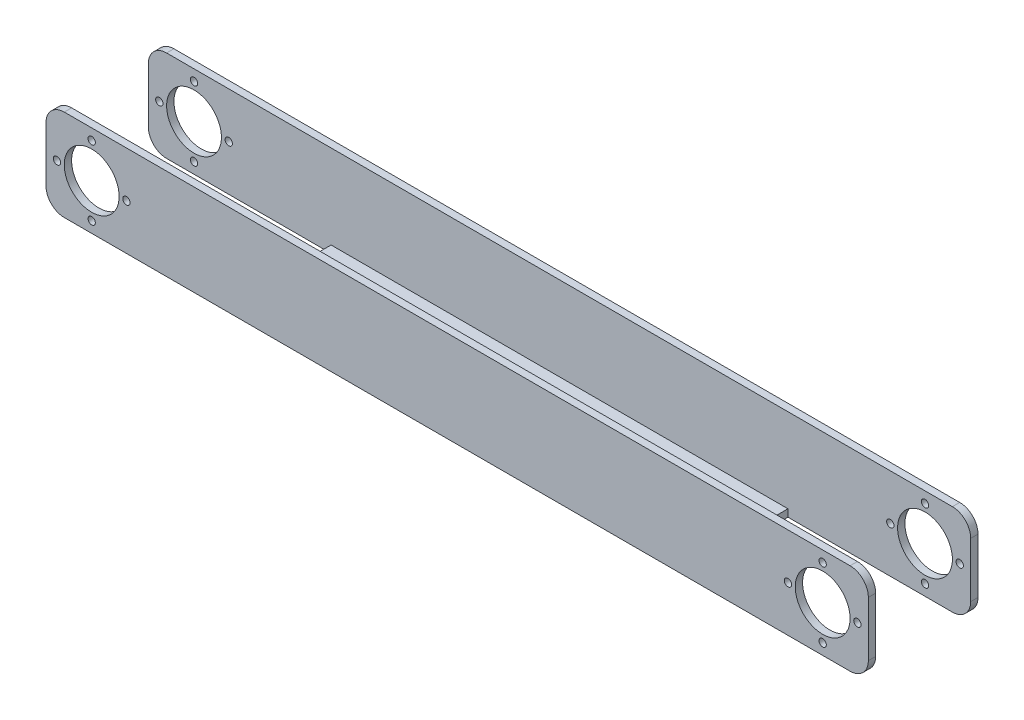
from build123d import *

# Parameters (mm, degrees)
SKETCH1_W           = 225
SKETCH1_H           = 25
BOSS_EXTRUDE1_DEPTH = 30
SHELL1_T            = -2
SKETCH5_W           = 50
SKETCH5_H           = 26
CUT_EXTRUDE4_DEPTH  = 120.085053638
SKETCH4_R           = 7.5
SKETCH4_R_2         = 1
CUT_EXTRUDE3_DEPTH  = 118.100384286
FILLET2_R           = 5


with BuildPart() as part:
    # Sketch1 → Boss-Extrude1 (new body)
    with BuildSketch(Plane.XY):
        Rectangle(SKETCH1_W, SKETCH1_H)
    extrude(amount=BOSS_EXTRUDE1_DEPTH)

    # Shell1
    shell1_openings = [part.faces().sort_by_distance(p)[0] for p in [
        (-112.5, 0, 15),
        (0, 12.5, 15),
        (112.5, 0, 15),
    ]]
    offset(amount=SHELL1_T, openings=shell1_openings, kind=Kind.INTERSECTION)

    # Sketch5 → Cut-Extrude4 (cut, through all)
    with BuildSketch(Plane.XZ.offset(12.5)):
        with Locations((-87.5, 15)):
            Rectangle(SKETCH5_W, SKETCH5_H)
        with Locations((87.5, 15)):
            Rectangle(SKETCH5_W, SKETCH5_H)
    extrude(amount=-CUT_EXTRUDE4_DEPTH, mode=Mode.SUBTRACT)

    # Sketch4 → Cut-Extrude3 (cut, through all)
    with BuildSketch(Plane.XY.offset(30)):
        with Locations((-100, 0)):
            Circle(SKETCH4_R)
        with Locations((100, 0)):
            Circle(SKETCH4_R)
        with Locations((100, 9.5)):
            Circle(SKETCH4_R_2)
        with Locations((109.5, 0)):
            Circle(SKETCH4_R_2)
        with Locations((100, -9.5)):
            Circle(SKETCH4_R_2)
        with Locations((90.5, 0)):
            Circle(SKETCH4_R_2)
        with Locations((-90.5, 0)):
            Circle(SKETCH4_R_2)
        with Locations((-100, -9.5)):
            Circle(SKETCH4_R_2)
        with Locations((-109.5, 0)):
            Circle(SKETCH4_R_2)
        with Locations((-100, 9.5)):
            Circle(SKETCH4_R_2)
    extrude(amount=-CUT_EXTRUDE3_DEPTH, mode=Mode.SUBTRACT)

    # Fillet2
    fillet2_edges = [part.edges().sort_by_distance(p)[0] for p in [
        (-112.5, 12.5, 1),
        (112.5, 12.5, 1),
        (112.5, -12.5, 1),
        (-112.5, -12.5, 1),
        (112.5, -12.5, 29),
        (-112.5, -12.5, 29),
        (-112.5, 12.5, 29),
        (112.5, 12.5, 29),
    ]]
    fillet(fillet2_edges, radius=FILLET2_R)


solid = part.part
